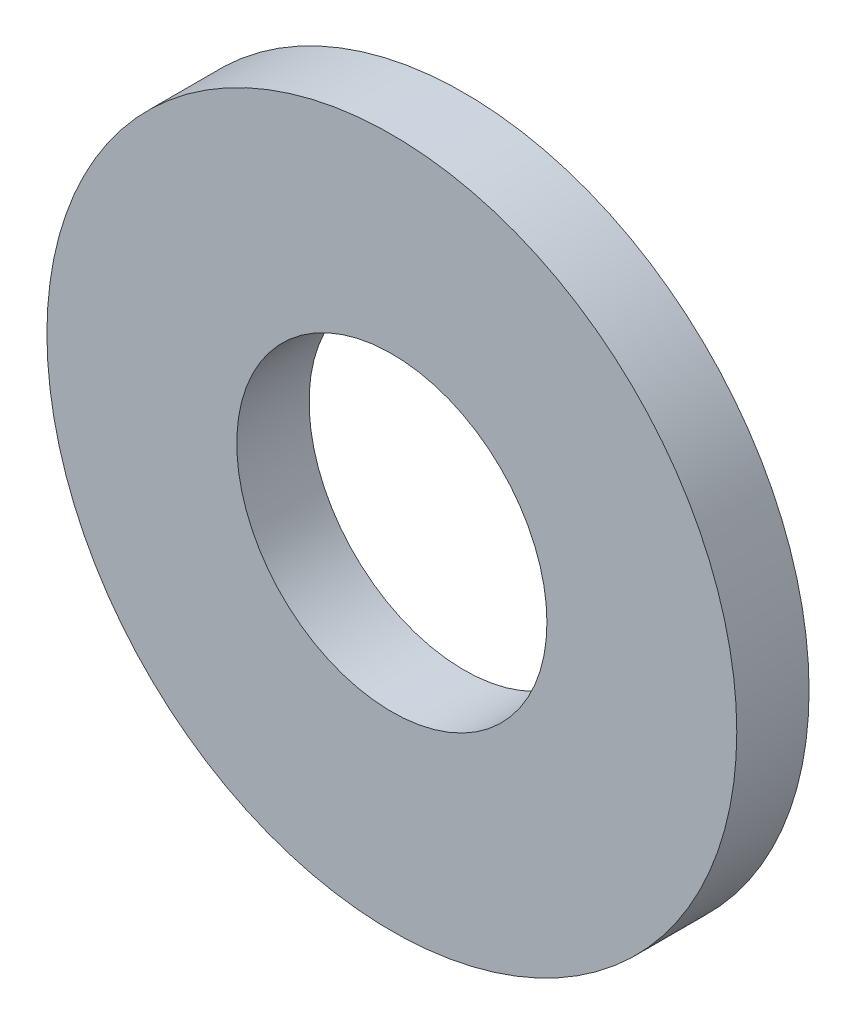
from build123d import *

# Parameters (mm, degrees)
BOSS_EXTRUDE1_DEPTH      = 0.83185
BOSS_EXTRUDE1_DEPTH_BACK = 0.83185
SKETCH3_R                = 7.9375
SKETCH3_R_2              = 3.5687


with BuildPart() as part:
    # Sketch3 → Boss-Extrude1 (new, two sides: drawn at the far end of the back side and taken through both)
    with BuildSketch(Plane.XY.offset(-BOSS_EXTRUDE1_DEPTH_BACK)):
        Circle(SKETCH3_R)
        Circle(SKETCH3_R_2, mode=Mode.SUBTRACT)
    extrude(amount=BOSS_EXTRUDE1_DEPTH + BOSS_EXTRUDE1_DEPTH_BACK)


solid = part.part
